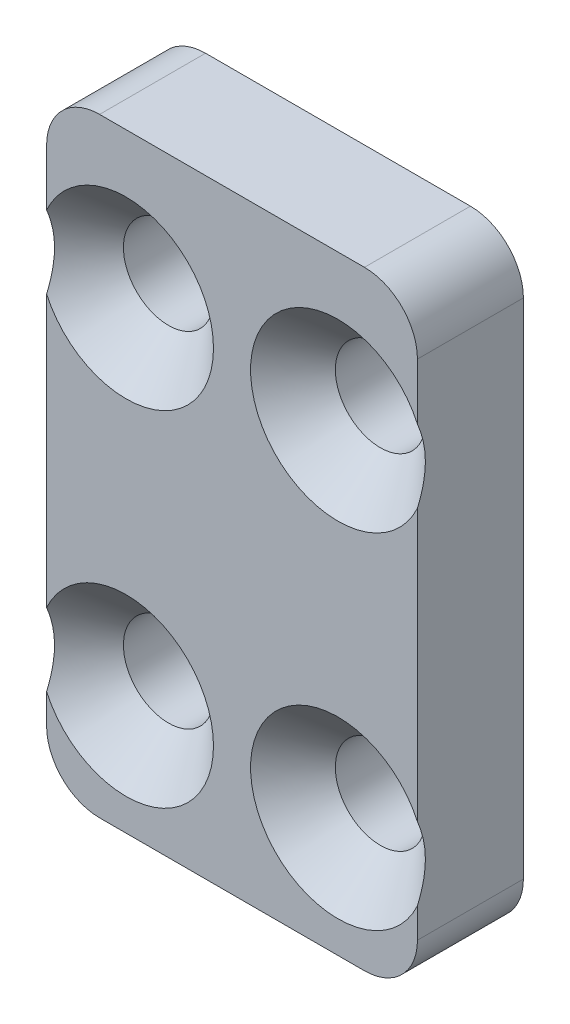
from build123d import *

# Parameters (mm, degrees)
SKETCH_1_W                   = 14
SKETCH_1_H                   = 23
EXTRUDE_1_DEPTH              = 4
HOLE_WIZARD_M3_1_D           = 3.4
HOLE_WIZARD_M3_1_CSINK_D     = 6.6
HOLE_WIZARD_M3_1_CSINK_ANGLE = 90
FILLET_1_R                   = 2


with BuildPart() as part:
    # Sketch 1 → Extrude 1 (new body)
    with BuildSketch(Plane.XY):
        Rectangle(SKETCH_1_W, SKETCH_1_H)
    extrude(amount=EXTRUDE_1_DEPTH)

    # Hole Wizard M3 _1 (through all)
    with Locations(Plane.XY.offset(4)):
        with Locations((-4, 6), (4, 6), (-4, -7), (4, -7)):
            CounterSinkHole(HOLE_WIZARD_M3_1_D / 2, HOLE_WIZARD_M3_1_CSINK_D / 2, counter_sink_angle=HOLE_WIZARD_M3_1_CSINK_ANGLE)

    # Fillet 1
    fillet_1_edges = [part.edges().sort_by_distance(p)[0] for p in [
        (7, -11.5, 2),
        (-7, -11.5, 2),
        (-7, 11.5, 2),
        (7, 11.5, 2),
    ]]
    fillet(fillet_1_edges, radius=FILLET_1_R)


solid = part.part
